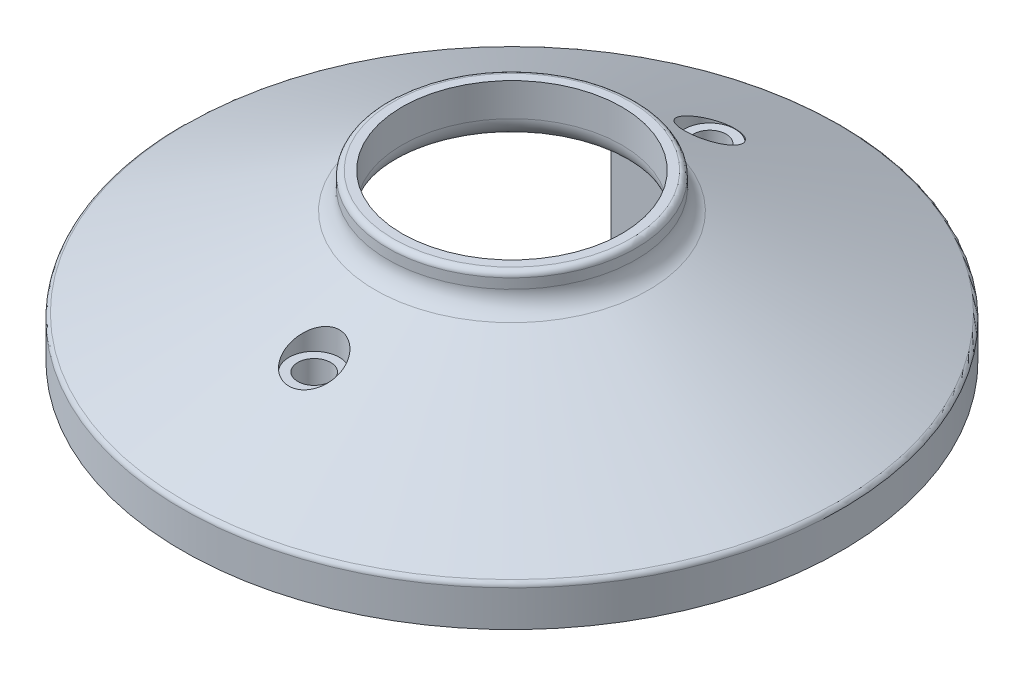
from build123d import *

# Parameters (mm, degrees)
BOSS_EXTRUDE3_REACH = 59.15
SKETCH6_W           = 12.7
SKETCH6_H           = 10.16
BOSS_EXTRUDE4_DEPTH = 10.16
SKETCH8_R           = 1.905
CUT_EXTRUDE3_DEPTH  = 58.15
SKETCH9_R           = 2.921
CUT_EXTRUDE4_DEPTH  = 8.763


with BuildPart() as part:
    # Sketch1 → Revolve1 (revolve)
    with BuildSketch(Plane.XY, mode=Mode.PRIVATE) as revolve1_sk:
        with BuildLine():
            Line((38.1, 0), (38.1, 4.175667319))
            ThreePointArc((38.1, 4.175667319), (38.000553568, 4.51685257), (37.733362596, 4.751172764))
            Line((37.733362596, 4.751172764), (15.817549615, 14.970684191))
            ThreePointArc((15.817549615, 14.970684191), (14.748785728, 15.907964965), (14.351, 17.272705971))
            Line((14.351, 17.272705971), (14.351, 18.415))
            ThreePointArc((14.351, 18.415), (14.165012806, 18.864012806), (13.716, 19.05))
            Line((13.716, 19.05), (12.7, 19.05))
            Line((12.7, 19.05), (12.7, 15.24))
            ThreePointArc((12.7, 15.24), (13.097785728, 13.875258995), (14.166549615, 12.937978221))
            Line((14.166549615, 12.937978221), (35.193362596, 3.133014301))
            ThreePointArc((35.193362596, 3.133014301), (35.460553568, 2.898694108), (35.56, 2.557508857))
            Line((35.56, 2.557508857), (35.56, 0))
            Line((35.56, 0), (38.1, 0))
        make_face()
    revolve1 = revolve(revolve1_sk.sketch.rotate(Axis((0, 0, 0), (0, 1, 0)), 90), axis=Axis((0, 0, 0), (0, 1, 0)))


with BuildPart() as mirror1_1:
    # Mirror1: Revolve1 across plane
    add(revolve1.mirror(Plane(origin=(0, 0, 0), x_dir=(0, 0, 1), z_dir=(1, 0, 0))))


with BuildPart() as part_1:
    add(part.part)

    # Mirror1 united with what the copies touc: union Mirror1_1
    add(mirror1_1.part)

    # Sketch6 → Boss-Extrude3 (add, up to next)
    with BuildSketch(Plane.XZ, mode=Mode.PRIVATE) as boss_extrude3_sk1:
        with Locations((0, -22.86)):
            Rectangle(SKETCH6_W, SKETCH6_H)
    boss_extrude3_tool1 = extrude(boss_extrude3_sk1.sketch, amount=-BOSS_EXTRUDE3_REACH, mode=Mode.PRIVATE) - part_1.part
    boss_extrude3 = boss_extrude3_tool1.solids().sort_by_distance((0, 0, -22.86))[0]
    add(boss_extrude3)

    # Sketch7 → Boss-Extrude4 (add)
    with BuildSketch(Plane.XZ):
        with BuildLine():
            Line((-2.54, -19.058476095), (-2.54, -17.78))
            Line((-2.54, -17.78), (-6.35, -17.78))
            Line((-6.35, -17.78), (-6.35, -22.86))
            Line((-6.35, -22.86), (-4.572, -22.86))
            ThreePointArc((-4.572, -22.86), (-4.032124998, -20.704738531), (-2.54, -19.058476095))
        make_face()
        with BuildLine():
            Line((6.35, -22.86), (4.572, -22.86))
            ThreePointArc((4.572, -22.86), (4.032124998, -20.704738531), (2.54, -19.058476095))
            Line((2.54, -19.058476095), (2.54, -17.78))
            Line((2.54, -17.78), (6.35, -17.78))
            Line((6.35, -17.78), (6.35, -22.86))
        make_face()
    boss_extrude4 = extrude(amount=BOSS_EXTRUDE4_DEPTH)

    # Sketch8 → Cut-Extrude3 (cut, through all)
    with BuildSketch(Plane.XZ):
        with Locations(Location((0, -22.86, 0), (0, 0, 270.000000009))):
            Circle(SKETCH8_R)
    cut_extrude3 = extrude(amount=-CUT_EXTRUDE3_DEPTH, mode=Mode.SUBTRACT)

    # Sketch9 → Cut-Extrude4 (cut)
    with BuildSketch(Plane(origin=(0, 19.05, 0), x_dir=(1, 0, 0), z_dir=(0, 1, 0))):
        with Locations(Location((0, 22.86, 0), (0, 0, 270))):
            Circle(SKETCH9_R)
    cut_extrude4 = extrude(amount=-CUT_EXTRUDE4_DEPTH, mode=Mode.SUBTRACT)

    # Mirror2: Boss-Extrude3, Boss-Extrude4, Cut-Extrude3, Cut-Extrude4 across plane
    add(boss_extrude3.mirror(Plane.XY))
    add(boss_extrude4.mirror(Plane.XY))
    add(cut_extrude3.mirror(Plane.XY), mode=Mode.SUBTRACT)
    add(cut_extrude4.mirror(Plane.XY), mode=Mode.SUBTRACT)


solid = part_1.part
